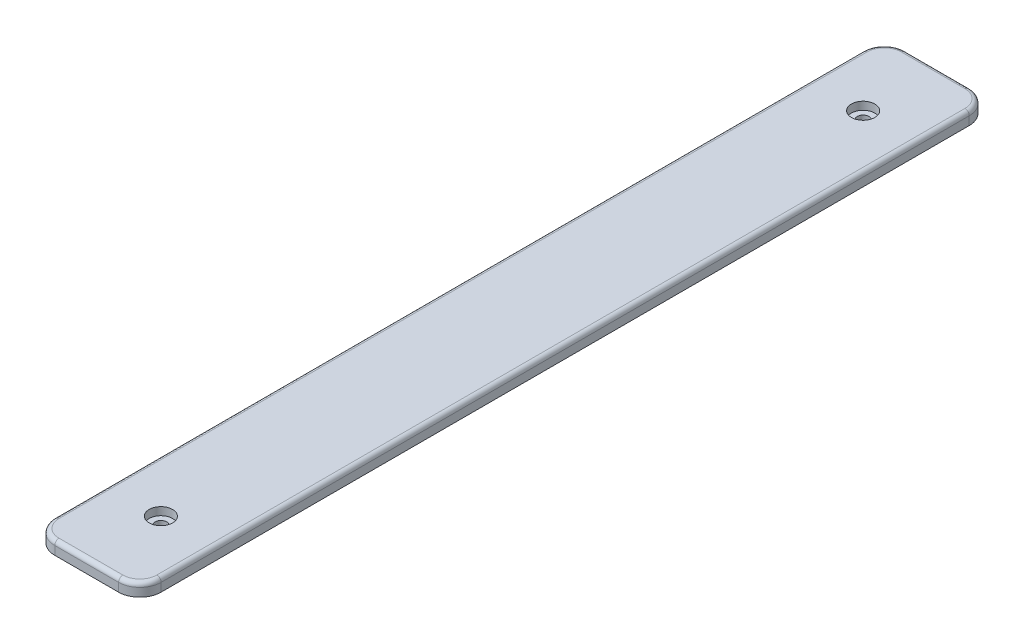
from build123d import *

# Parameters (mm, degrees)
SKETCH1_W                                        = 50
SKETCH1_H                                        = 400
EXTRUDE1_DEPTH                                   = 6
CBORE_FOR_M5_PAN_HEAD_MACHINE_SCREW1_D           = 5.5
CBORE_FOR_M5_PAN_HEAD_MACHINE_SCREW1_CBORE_D     = 11
CBORE_FOR_M5_PAN_HEAD_MACHINE_SCREW1_CBORE_DEPTH = 3.7
FILLET1_R                                        = 10
FILLET2_R                                        = 2


with BuildPart() as part:
    # Sketch1 → Extrude1 (new body)
    with BuildSketch(Plane(origin=(0, 0, 0), x_dir=(1, 0, 0), z_dir=(0, 1, 0))):
        Rectangle(SKETCH1_W, SKETCH1_H)
    extrude(amount=EXTRUDE1_DEPTH)

    # CBORE for M5 Pan Head Machine Screw1 (through all)
    with Locations(Plane(origin=(0, 6, 0), x_dir=(-1, 0, 0), z_dir=(0, 1, 0))):
        with Locations((0, 165.1), (0, -165.1)):
            CounterBoreHole(CBORE_FOR_M5_PAN_HEAD_MACHINE_SCREW1_D / 2, CBORE_FOR_M5_PAN_HEAD_MACHINE_SCREW1_CBORE_D / 2, CBORE_FOR_M5_PAN_HEAD_MACHINE_SCREW1_CBORE_DEPTH)

    # Fillet1
    fillet1_edges = [part.edges().sort_by_distance(p)[0] for p in [
        (-25, 3, -200),
        (25, 3, -200),
        (25, 3, 200),
        (-25, 3, 200),
    ]]
    fillet(fillet1_edges, radius=FILLET1_R)

    # Fillet2
    fillet2_edges = [part.edges().sort_by_distance(p)[0] for p in [
        (-25, 6, 0),
        (0, 6, -200),
        (0, 6, 200),
        (25, 6, 0),
        (-22.071067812, 6, 197.071067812),
        (22.071067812, 6, 197.071067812),
        (22.071067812, 6, -197.071067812),
        (-22.071067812, 6, -197.071067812),
    ]]
    fillet(fillet2_edges, radius=FILLET2_R)


solid = part.part
